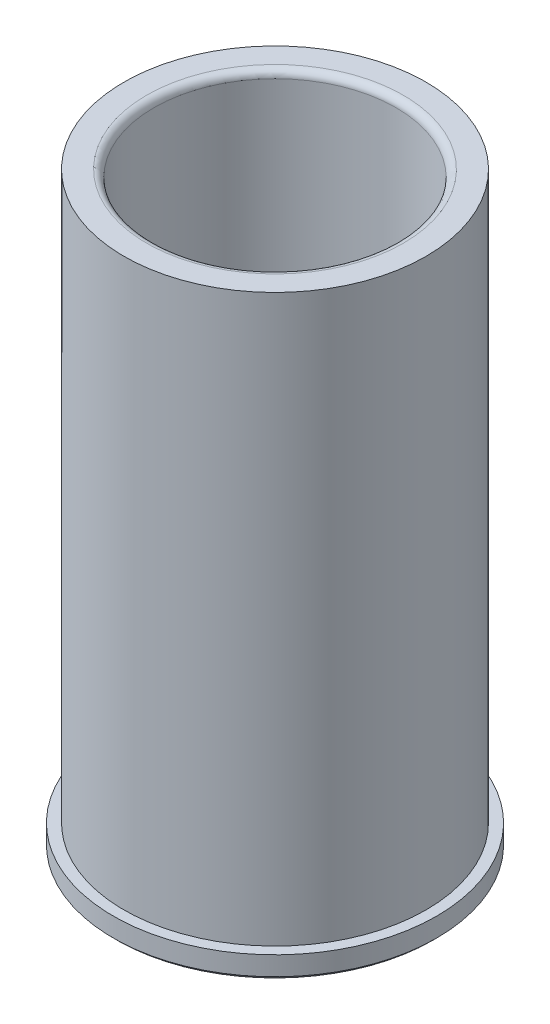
ISO-10303-21;
HEADER;
FILE_DESCRIPTION(('STEP AP214'),'2;1');
FILE_NAME('part.step','',(''),(''),'','','');
FILE_SCHEMA(('AUTOMOTIVE_DESIGN { 1 0 10303 214 1 1 1 1 }'));
ENDSEC;
DATA;
#1=APPLICATION_CONTEXT('core data for automotive mechanical design processes');
#2=APPLICATION_PROTOCOL_DEFINITION('international standard','automotive_design',2000,#1);
#3=PRODUCT_CONTEXT('',#1,'mechanical');
#4=PRODUCT('Part','Part','',(#3));
#5=PRODUCT_RELATED_PRODUCT_CATEGORY('part','',(#4));
#6=PRODUCT_DEFINITION_FORMATION('','',#4);
#7=PRODUCT_DEFINITION_CONTEXT('part definition',#1,'design');
#8=PRODUCT_DEFINITION('design','',#6,#7);
#9=PRODUCT_DEFINITION_SHAPE('','',#8);
#10=(LENGTH_UNIT() NAMED_UNIT(*) SI_UNIT(.MILLI.,.METRE.));
#11=(NAMED_UNIT(*) PLANE_ANGLE_UNIT() SI_UNIT($,.RADIAN.));
#12=(NAMED_UNIT(*) SI_UNIT($,.STERADIAN.) SOLID_ANGLE_UNIT());
#13=UNCERTAINTY_MEASURE_WITH_UNIT(LENGTH_MEASURE(1.E-05),#10,'distance_accuracy_value','');
#14=(GEOMETRIC_REPRESENTATION_CONTEXT(3) GLOBAL_UNCERTAINTY_ASSIGNED_CONTEXT((#13)) GLOBAL_UNIT_ASSIGNED_CONTEXT((#10,
#11,#12)) REPRESENTATION_CONTEXT('',''));
#15=CARTESIAN_POINT('',(0.,0.,0.));
#16=DIRECTION('',(0.,0.,1.));
#17=DIRECTION('',(1.,0.,0.));
#18=AXIS2_PLACEMENT_3D('',#15,#16,#17);
#19=CARTESIAN_POINT('',(3.49148336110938E-12,-1000.,0.));
#20=DIRECTION('',(0.,-1.,0.));
#21=DIRECTION('',(1.,0.,0.));
#22=AXIS2_PLACEMENT_3D('',#19,#20,#21);
#23=CYLINDRICAL_SURFACE('',#22,31.7563499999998);
#24=CARTESIAN_POINT('',(0.,4.7625,0.));
#25=DIRECTION('',(0.,-1.,0.));
#26=DIRECTION('',(1.,0.,0.));
#27=AXIS2_PLACEMENT_3D('',#24,#25,#26);
#28=CIRCLE('',#27,31.75635);
#29=CARTESIAN_POINT('',(31.75635,4.76250000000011,0.));
#30=VERTEX_POINT('',#29);
#31=EDGE_CURVE('E39',#30,#30,#28,.T.);
#32=ORIENTED_EDGE('',*,*,#31,.F.);
#33=EDGE_LOOP('',(#32));
#34=FACE_BOUND('',#33,.T.);
#35=CARTESIAN_POINT('',(-4.3233292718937E-13,123.825,0.));
#36=DIRECTION('',(0.,-1.,0.));
#37=DIRECTION('',(1.,0.,0.));
#38=AXIS2_PLACEMENT_3D('',#35,#36,#37);
#39=CIRCLE('',#38,31.7563499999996);
#40=CARTESIAN_POINT('',(31.7563499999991,123.825,0.));
#41=VERTEX_POINT('',#40);
#42=EDGE_CURVE('E60',#41,#41,#39,.T.);
#43=ORIENTED_EDGE('',*,*,#42,.T.);
#44=EDGE_LOOP('',(#43));
#45=FACE_BOUND('',#44,.T.);
#46=ADVANCED_FACE('F28',(#34,#45),#23,.T.);
#47=CARTESIAN_POINT('',(-33.9979,4.76249999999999,0.));
#48=DIRECTION('',(0.,-1.,0.));
#49=DIRECTION('',(1.,0.,0.));
#50=AXIS2_PLACEMENT_3D('',#47,#48,#49);
#51=PLANE('',#50);
#52=CARTESIAN_POINT('',(0.,4.76250000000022,0.));
#53=DIRECTION('',(0.,-1.,0.));
#54=DIRECTION('',(1.,0.,0.));
#55=AXIS2_PLACEMENT_3D('',#52,#53,#54);
#56=CIRCLE('',#55,33.9979);
#57=CARTESIAN_POINT('',(33.9979,4.76250000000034,0.));
#58=VERTEX_POINT('',#57);
#59=EDGE_CURVE('E43',#58,#58,#56,.T.);
#60=ORIENTED_EDGE('',*,*,#59,.F.);
#61=EDGE_LOOP('',(#60));
#62=FACE_BOUND('',#61,.T.);
#63=ORIENTED_EDGE('',*,*,#31,.T.);
#64=EDGE_LOOP('',(#63));
#65=FACE_BOUND('',#64,.T.);
#66=ADVANCED_FACE('F77',(#62,#65),#51,.F.);
#67=CARTESIAN_POINT('',(3.49148336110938E-12,-1000.,0.));
#68=DIRECTION('',(0.,-1.,0.));
#69=DIRECTION('',(1.,0.,0.));
#70=AXIS2_PLACEMENT_3D('',#67,#68,#69);
#71=CYLINDRICAL_SURFACE('',#70,33.9979);
#72=CARTESIAN_POINT('',(0.,0.762000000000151,0.));
#73=DIRECTION('',(0.,-1.,0.));
#74=DIRECTION('',(1.,0.,0.));
#75=AXIS2_PLACEMENT_3D('',#72,#73,#74);
#76=CIRCLE('',#75,33.9979);
#77=CARTESIAN_POINT('',(33.9979,0.76200000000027,0.));
#78=VERTEX_POINT('',#77);
#79=EDGE_CURVE('E48',#78,#78,#76,.T.);
#80=ORIENTED_EDGE('',*,*,#79,.F.);
#81=EDGE_LOOP('',(#80));
#82=FACE_BOUND('',#81,.T.);
#83=ORIENTED_EDGE('',*,*,#59,.T.);
#84=EDGE_LOOP('',(#83));
#85=FACE_BOUND('',#84,.T.);
#86=ADVANCED_FACE('F82',(#82,#85),#71,.T.);
#87=CARTESIAN_POINT('',(0.,0.762000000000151,0.));
#88=DIRECTION('',(0.,1.,0.));
#89=DIRECTION('',(-1.,0.,0.));
#90=AXIS2_PLACEMENT_3D('',#87,#88,#89);
#91=CONICAL_SURFACE('',#90,33.9979,0.785398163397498);
#92=CARTESIAN_POINT('',(0.,2.22044604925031E-13,0.));
#93=DIRECTION('',(0.,-1.,0.));
#94=DIRECTION('',(1.,0.,0.));
#95=AXIS2_PLACEMENT_3D('',#92,#93,#94);
#96=CIRCLE('',#95,33.2359);
#97=CARTESIAN_POINT('',(33.2359,3.38087196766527E-13,0.));
#98=VERTEX_POINT('',#97);
#99=EDGE_CURVE('E51',#98,#98,#96,.T.);
#100=ORIENTED_EDGE('',*,*,#99,.F.);
#101=EDGE_LOOP('',(#100));
#102=FACE_BOUND('',#101,.T.);
#103=ORIENTED_EDGE('',*,*,#79,.T.);
#104=EDGE_LOOP('',(#103));
#105=FACE_BOUND('',#104,.T.);
#106=ADVANCED_FACE('F89',(#102,#105),#91,.T.);
#107=CARTESIAN_POINT('',(-26.2255,0.,0.));
#108=DIRECTION('',(0.,1.,0.));
#109=DIRECTION('',(-1.,0.,0.));
#110=AXIS2_PLACEMENT_3D('',#107,#108,#109);
#111=PLANE('',#110);
#112=CARTESIAN_POINT('',(0.,0.,0.));
#113=DIRECTION('',(0.,-1.,0.));
#114=DIRECTION('',(1.,0.,0.));
#115=AXIS2_PLACEMENT_3D('',#112,#113,#114);
#116=CIRCLE('',#115,26.2255);
#117=CARTESIAN_POINT('',(26.2255,0.,0.));
#118=VERTEX_POINT('',#117);
#119=EDGE_CURVE('E54',#118,#118,#116,.T.);
#120=ORIENTED_EDGE('',*,*,#119,.F.);
#121=EDGE_LOOP('',(#120));
#122=FACE_BOUND('',#121,.T.);
#123=ORIENTED_EDGE('',*,*,#99,.T.);
#124=EDGE_LOOP('',(#123));
#125=FACE_BOUND('',#124,.T.);
#126=ADVANCED_FACE('F93',(#122,#125),#111,.F.);
#127=CARTESIAN_POINT('',(0.,0.,0.));
#128=DIRECTION('',(0.,-1.,0.));
#129=DIRECTION('',(1.,0.,0.));
#130=AXIS2_PLACEMENT_3D('',#127,#128,#129);
#131=CONICAL_SURFACE('',#130,26.2255,0.785398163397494);
#132=CARTESIAN_POINT('',(0.,0.761999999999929,0.));
#133=DIRECTION('',(0.,-1.,0.));
#134=DIRECTION('',(1.,0.,0.));
#135=AXIS2_PLACEMENT_3D('',#132,#133,#134);
#136=CIRCLE('',#135,25.4635);
#137=CARTESIAN_POINT('',(25.4635,0.762000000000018,0.));
#138=VERTEX_POINT('',#137);
#139=EDGE_CURVE('E57',#138,#138,#136,.T.);
#140=ORIENTED_EDGE('',*,*,#139,.F.);
#141=EDGE_LOOP('',(#140));
#142=FACE_BOUND('',#141,.T.);
#143=ORIENTED_EDGE('',*,*,#119,.T.);
#144=EDGE_LOOP('',(#143));
#145=FACE_BOUND('',#144,.T.);
#146=ADVANCED_FACE('F74',(#142,#145),#131,.F.);
#147=CARTESIAN_POINT('',(3.49148336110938E-12,-1000.,0.));
#148=DIRECTION('',(0.,-1.,0.));
#149=DIRECTION('',(1.,0.,0.));
#150=AXIS2_PLACEMENT_3D('',#147,#148,#149);
#151=CYLINDRICAL_SURFACE('',#150,25.4634999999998);
#152=CARTESIAN_POINT('',(-4.27011906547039E-13,122.301,0.));
#153=DIRECTION('',(0.,-1.,0.));
#154=DIRECTION('',(1.,0.,0.));
#155=AXIS2_PLACEMENT_3D('',#152,#153,#154);
#156=CIRCLE('',#155,25.4634999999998);
#157=CARTESIAN_POINT('',(25.4634999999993,122.301,0.));
#158=VERTEX_POINT('',#157);
#159=EDGE_CURVE('E10',#158,#158,#156,.F.);
#160=ORIENTED_EDGE('',*,*,#159,.T.);
#161=EDGE_LOOP('',(#160));
#162=FACE_BOUND('',#161,.T.);
#163=ORIENTED_EDGE('',*,*,#139,.T.);
#164=EDGE_LOOP('',(#163));
#165=FACE_BOUND('',#164,.T.);
#166=ADVANCED_FACE('F67',(#162,#165),#151,.F.);
#167=CARTESIAN_POINT('',(-31.75635,123.825,0.));
#168=DIRECTION('',(0.,-1.,0.));
#169=DIRECTION('',(1.,0.,0.));
#170=AXIS2_PLACEMENT_3D('',#167,#168,#169);
#171=PLANE('',#170);
#172=CARTESIAN_POINT('',(-4.3233292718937E-13,123.825,0.));
#173=DIRECTION('',(0.,-1.,0.));
#174=DIRECTION('',(1.,0.,0.));
#175=AXIS2_PLACEMENT_3D('',#172,#173,#174);
#176=CIRCLE('',#175,26.9874999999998);
#177=CARTESIAN_POINT('',(26.9874999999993,123.825,0.));
#178=VERTEX_POINT('',#177);
#179=EDGE_CURVE('E35',#178,#178,#176,.T.);
#180=ORIENTED_EDGE('',*,*,#179,.T.);
#181=EDGE_LOOP('',(#180));
#182=FACE_BOUND('',#181,.T.);
#183=ORIENTED_EDGE('',*,*,#42,.F.);
#184=EDGE_LOOP('',(#183));
#185=FACE_BOUND('',#184,.T.);
#186=ADVANCED_FACE('F65',(#182,#185),#171,.F.);
#187=CARTESIAN_POINT('',(-4.27011906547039E-13,122.301,0.));
#188=DIRECTION('',(0.,-1.,0.));
#189=DIRECTION('',(1.,0.,0.));
#190=AXIS2_PLACEMENT_3D('',#187,#188,#189);
#191=TOROIDAL_SURFACE('',#190,26.9874999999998,1.524);
#192=ORIENTED_EDGE('',*,*,#159,.F.);
#193=EDGE_LOOP('',(#192));
#194=FACE_BOUND('',#193,.T.);
#195=ORIENTED_EDGE('',*,*,#179,.F.);
#196=EDGE_LOOP('',(#195));
#197=FACE_BOUND('',#196,.T.);
#198=ADVANCED_FACE('F30',(#194,#197),#191,.T.);
#199=CLOSED_SHELL('',(#46,#66,#86,#106,#126,#146,#166,#186,#198));
#200=MANIFOLD_SOLID_BREP('B2',#199);
#201=ADVANCED_BREP_SHAPE_REPRESENTATION('',(#18,#200),#14);
#202=SHAPE_DEFINITION_REPRESENTATION(#9,#201);
ENDSEC;
END-ISO-10303-21;
